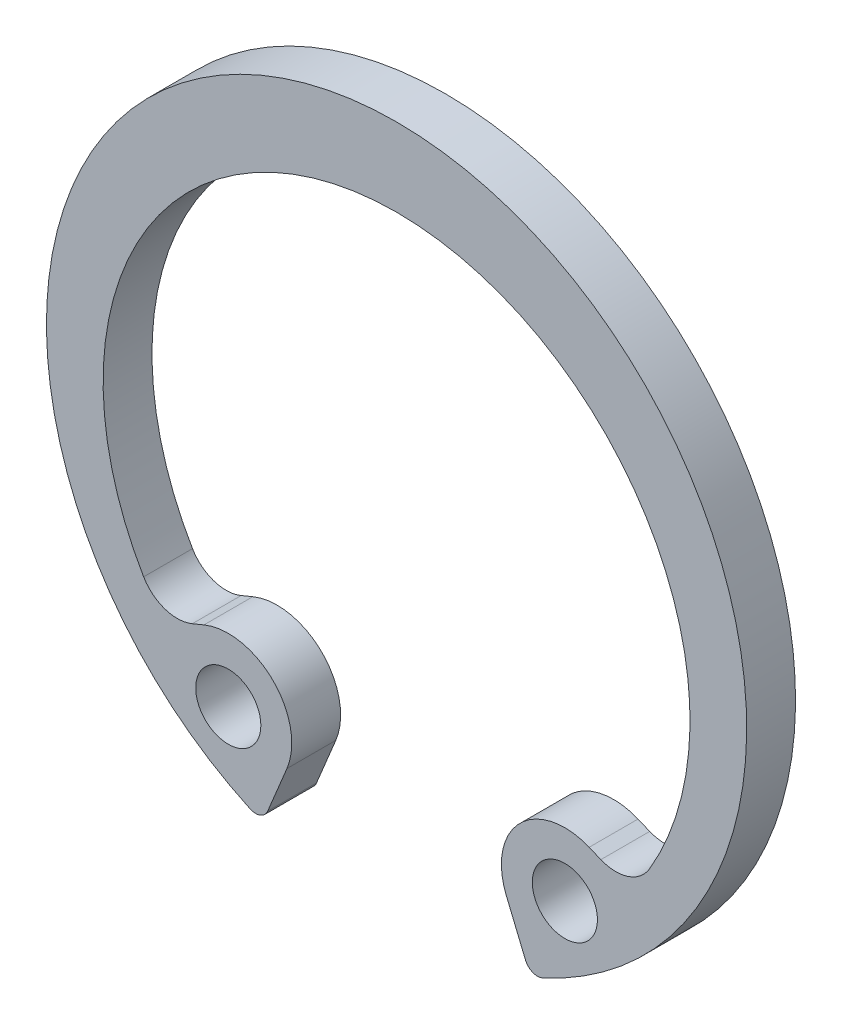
ISO-10303-21;
HEADER;
FILE_DESCRIPTION(('STEP AP214'),'2;1');
FILE_NAME('part.step','',(''),(''),'','','');
FILE_SCHEMA(('AUTOMOTIVE_DESIGN { 1 0 10303 214 1 1 1 1 }'));
ENDSEC;
DATA;
#1=APPLICATION_CONTEXT('core data for automotive mechanical design processes');
#2=APPLICATION_PROTOCOL_DEFINITION('international standard','automotive_design',2000,#1);
#3=PRODUCT_CONTEXT('',#1,'mechanical');
#4=PRODUCT('Part','Part','',(#3));
#5=PRODUCT_RELATED_PRODUCT_CATEGORY('part','',(#4));
#6=PRODUCT_DEFINITION_FORMATION('','',#4);
#7=PRODUCT_DEFINITION_CONTEXT('part definition',#1,'design');
#8=PRODUCT_DEFINITION('design','',#6,#7);
#9=PRODUCT_DEFINITION_SHAPE('','',#8);
#10=(LENGTH_UNIT() NAMED_UNIT(*) SI_UNIT(.MILLI.,.METRE.));
#11=(NAMED_UNIT(*) PLANE_ANGLE_UNIT() SI_UNIT($,.RADIAN.));
#12=(NAMED_UNIT(*) SI_UNIT($,.STERADIAN.) SOLID_ANGLE_UNIT());
#13=UNCERTAINTY_MEASURE_WITH_UNIT(LENGTH_MEASURE(1.E-05),#10,'distance_accuracy_value','');
#14=(GEOMETRIC_REPRESENTATION_CONTEXT(3) GLOBAL_UNCERTAINTY_ASSIGNED_CONTEXT((#13)) GLOBAL_UNIT_ASSIGNED_CONTEXT((#10,
#11,#12)) REPRESENTATION_CONTEXT('',''));
#15=CARTESIAN_POINT('',(0.,0.,0.));
#16=DIRECTION('',(0.,0.,1.));
#17=DIRECTION('',(1.,0.,0.));
#18=AXIS2_PLACEMENT_3D('',#15,#16,#17);
#19=CARTESIAN_POINT('',(-5.16725455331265,-7.38102840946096,1.5));
#20=DIRECTION('',(0.,0.,-1.));
#21=DIRECTION('',(-1.,0.,0.));
#22=AXIS2_PLACEMENT_3D('',#19,#20,#21);
#23=CYLINDRICAL_SURFACE('',#22,1.9493234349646);
#24=CARTESIAN_POINT('',(-5.16725455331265,-7.38102840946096,0.));
#25=DIRECTION('',(0.,0.,1.));
#26=DIRECTION('',(1.,0.,0.));
#27=AXIS2_PLACEMENT_3D('',#24,#25,#26);
#28=CIRCLE('',#27,1.9493234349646);
#29=CARTESIAN_POINT('',(-5.91322833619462,-5.58008838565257,0.));
#30=VERTEX_POINT('',#29);
#31=CARTESIAN_POINT('',(-3.36631452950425,-8.12700219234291,0.));
#32=VERTEX_POINT('',#31);
#33=EDGE_CURVE('E139',#30,#32,#28,.F.);
#34=ORIENTED_EDGE('',*,*,#33,.F.);
#35=DIRECTION('',(0.,0.,-1.));
#36=VECTOR('',#35,1.);
#37=CARTESIAN_POINT('',(-5.91322833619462,-5.58008838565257,1.5));
#38=LINE('',#37,#36);
#39=CARTESIAN_POINT('',(-5.91322833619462,-5.58008838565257,1.5));
#40=VERTEX_POINT('',#39);
#41=EDGE_CURVE('E134',#40,#30,#38,.T.);
#42=ORIENTED_EDGE('',*,*,#41,.F.);
#43=CARTESIAN_POINT('',(-5.16725455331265,-7.38102840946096,1.5));
#44=DIRECTION('',(0.,0.,1.));
#45=DIRECTION('',(1.,0.,0.));
#46=AXIS2_PLACEMENT_3D('',#43,#44,#45);
#47=CIRCLE('',#46,1.9493234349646);
#48=CARTESIAN_POINT('',(-3.36631452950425,-8.12700219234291,1.5));
#49=VERTEX_POINT('',#48);
#50=EDGE_CURVE('E137',#40,#49,#47,.F.);
#51=ORIENTED_EDGE('',*,*,#50,.T.);
#52=DIRECTION('',(0.,0.,-1.));
#53=VECTOR('',#52,1.);
#54=CARTESIAN_POINT('',(-3.36631452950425,-8.12700219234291,1.5));
#55=LINE('',#54,#53);
#56=EDGE_CURVE('E181',#49,#32,#55,.T.);
#57=ORIENTED_EDGE('',*,*,#56,.T.);
#58=EDGE_LOOP('',(#34,#42,#51,#57));
#59=FACE_BOUND('',#58,.T.);
#60=ADVANCED_FACE('F41',(#59),#23,.T.);
#61=CARTESIAN_POINT('',(1.10688692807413,-2.67226143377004,1.5));
#62=DIRECTION('',(0.382683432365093,-0.923879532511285,0.));
#63=DIRECTION('',(0.923879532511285,0.382683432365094,0.));
#64=AXIS2_PLACEMENT_3D('',#61,#62,#63);
#65=PLANE('',#64);
#66=DIRECTION('',(-0.923879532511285,-0.382683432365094,0.));
#67=VECTOR('',#66,1.);
#68=CARTESIAN_POINT('',(1.10688692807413,-2.67226143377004,0.));
#69=LINE('',#68,#67);
#70=CARTESIAN_POINT('',(-6.27228970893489,-5.7288164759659,0.));
#71=VERTEX_POINT('',#70);
#72=EDGE_CURVE('E183',#30,#71,#69,.T.);
#73=ORIENTED_EDGE('',*,*,#72,.T.);
#74=DIRECTION('',(0.,0.,1.));
#75=VECTOR('',#74,1.);
#76=CARTESIAN_POINT('',(-6.27228970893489,-5.7288164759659,1.5));
#77=LINE('',#76,#75);
#78=CARTESIAN_POINT('',(-6.27228970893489,-5.7288164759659,1.5));
#79=VERTEX_POINT('',#78);
#80=EDGE_CURVE('E150',#71,#79,#77,.T.);
#81=ORIENTED_EDGE('',*,*,#80,.T.);
#82=DIRECTION('',(-0.923879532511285,-0.382683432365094,0.));
#83=VECTOR('',#82,1.);
#84=CARTESIAN_POINT('',(1.10688692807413,-2.67226143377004,1.5));
#85=LINE('',#84,#83);
#86=EDGE_CURVE('E147',#40,#79,#85,.T.);
#87=ORIENTED_EDGE('',*,*,#86,.F.);
#88=ORIENTED_EDGE('',*,*,#41,.T.);
#89=EDGE_LOOP('',(#73,#81,#87,#88));
#90=FACE_BOUND('',#89,.T.);
#91=ADVANCED_FACE('F148',(#90),#65,.F.);
#92=CARTESIAN_POINT('',(0.,-0.660000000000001,1.5));
#93=DIRECTION('',(0.,0.,-1.));
#94=DIRECTION('',(-1.,0.,0.));
#95=AXIS2_PLACEMENT_3D('',#92,#93,#94);
#96=CYLINDRICAL_SURFACE('',#95,9.01);
#97=CARTESIAN_POINT('',(0.,-0.660000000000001,0.));
#98=DIRECTION('',(0.,0.,1.));
#99=DIRECTION('',(1.,0.,0.));
#100=AXIS2_PLACEMENT_3D('',#97,#98,#99);
#101=CIRCLE('',#100,9.01);
#102=CARTESIAN_POINT('',(-7.76580071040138,-5.22863648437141,0.));
#103=VERTEX_POINT('',#102);
#104=CARTESIAN_POINT('',(7.76580071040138,-5.22863648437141,0.));
#105=VERTEX_POINT('',#104);
#106=EDGE_CURVE('E185',#103,#105,#101,.F.);
#107=ORIENTED_EDGE('',*,*,#106,.T.);
#108=DIRECTION('',(0.,0.,-1.));
#109=VECTOR('',#108,1.);
#110=CARTESIAN_POINT('',(7.76580071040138,-5.22863648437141,1.5));
#111=LINE('',#110,#109);
#112=CARTESIAN_POINT('',(7.76580071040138,-5.22863648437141,1.5));
#113=VERTEX_POINT('',#112);
#114=EDGE_CURVE('E213',#105,#113,#111,.F.);
#115=ORIENTED_EDGE('',*,*,#114,.T.);
#116=CARTESIAN_POINT('',(0.,-0.660000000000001,1.5));
#117=DIRECTION('',(0.,0.,1.));
#118=DIRECTION('',(1.,0.,0.));
#119=AXIS2_PLACEMENT_3D('',#116,#117,#118);
#120=CIRCLE('',#119,9.01);
#121=CARTESIAN_POINT('',(-7.76580071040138,-5.22863648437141,1.5));
#122=VERTEX_POINT('',#121);
#123=EDGE_CURVE('E152',#122,#113,#120,.F.);
#124=ORIENTED_EDGE('',*,*,#123,.F.);
#125=DIRECTION('',(0.,0.,-1.));
#126=VECTOR('',#125,1.);
#127=CARTESIAN_POINT('',(-7.76580071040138,-5.22863648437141,1.5));
#128=LINE('',#127,#126);
#129=EDGE_CURVE('E210',#122,#103,#128,.T.);
#130=ORIENTED_EDGE('',*,*,#129,.T.);
#131=EDGE_LOOP('',(#107,#115,#124,#130));
#132=FACE_BOUND('',#131,.T.);
#133=ADVANCED_FACE('F264',(#132),#96,.F.);
#134=CARTESIAN_POINT('',(-1.10688692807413,-2.67226143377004,1.5));
#135=DIRECTION('',(0.382683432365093,0.923879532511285,0.));
#136=DIRECTION('',(-0.923879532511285,0.382683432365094,0.));
#137=AXIS2_PLACEMENT_3D('',#134,#135,#136);
#138=PLANE('',#137);
#139=DIRECTION('',(0.923879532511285,-0.382683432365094,0.));
#140=VECTOR('',#139,1.);
#141=CARTESIAN_POINT('',(-1.10688692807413,-2.67226143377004,1.5));
#142=LINE('',#141,#140);
#143=CARTESIAN_POINT('',(5.91322833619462,-5.58008838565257,1.5));
#144=VERTEX_POINT('',#143);
#145=CARTESIAN_POINT('',(6.27228970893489,-5.7288164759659,1.5));
#146=VERTEX_POINT('',#145);
#147=EDGE_CURVE('E165',#144,#146,#142,.T.);
#148=ORIENTED_EDGE('',*,*,#147,.T.);
#149=DIRECTION('',(0.,0.,-1.));
#150=VECTOR('',#149,1.);
#151=CARTESIAN_POINT('',(6.27228970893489,-5.72881647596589,1.5));
#152=LINE('',#151,#150);
#153=CARTESIAN_POINT('',(6.27228970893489,-5.7288164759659,0.));
#154=VERTEX_POINT('',#153);
#155=EDGE_CURVE('E143',#146,#154,#152,.T.);
#156=ORIENTED_EDGE('',*,*,#155,.T.);
#157=DIRECTION('',(0.923879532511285,-0.382683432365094,0.));
#158=VECTOR('',#157,1.);
#159=CARTESIAN_POINT('',(-1.10688692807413,-2.67226143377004,0.));
#160=LINE('',#159,#158);
#161=CARTESIAN_POINT('',(5.91322833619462,-5.58008838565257,0.));
#162=VERTEX_POINT('',#161);
#163=EDGE_CURVE('E188',#162,#154,#160,.T.);
#164=ORIENTED_EDGE('',*,*,#163,.F.);
#165=DIRECTION('',(0.,0.,-1.));
#166=VECTOR('',#165,1.);
#167=CARTESIAN_POINT('',(5.91322833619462,-5.58008838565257,1.5));
#168=LINE('',#167,#166);
#169=EDGE_CURVE('E144',#144,#162,#168,.T.);
#170=ORIENTED_EDGE('',*,*,#169,.F.);
#171=EDGE_LOOP('',(#148,#156,#164,#170));
#172=FACE_BOUND('',#171,.T.);
#173=ADVANCED_FACE('F256',(#172),#138,.T.);
#174=CARTESIAN_POINT('',(5.16725455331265,-7.38102840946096,1.5));
#175=DIRECTION('',(0.,0.,-1.));
#176=DIRECTION('',(-1.,0.,0.));
#177=AXIS2_PLACEMENT_3D('',#174,#175,#176);
#178=CYLINDRICAL_SURFACE('',#177,1.9493234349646);
#179=CARTESIAN_POINT('',(5.16725455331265,-7.38102840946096,0.));
#180=DIRECTION('',(0.,0.,1.));
#181=DIRECTION('',(1.,0.,0.));
#182=AXIS2_PLACEMENT_3D('',#179,#180,#181);
#183=CIRCLE('',#182,1.9493234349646);
#184=CARTESIAN_POINT('',(3.36631452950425,-8.12700219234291,0.));
#185=VERTEX_POINT('',#184);
#186=EDGE_CURVE('E191',#162,#185,#183,.T.);
#187=ORIENTED_EDGE('',*,*,#186,.T.);
#188=DIRECTION('',(0.,0.,-1.));
#189=VECTOR('',#188,1.);
#190=CARTESIAN_POINT('',(3.36631452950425,-8.12700219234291,1.5));
#191=LINE('',#190,#189);
#192=CARTESIAN_POINT('',(3.36631452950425,-8.12700219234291,1.5));
#193=VERTEX_POINT('',#192);
#194=EDGE_CURVE('E204',#193,#185,#191,.T.);
#195=ORIENTED_EDGE('',*,*,#194,.F.);
#196=CARTESIAN_POINT('',(5.16725455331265,-7.38102840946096,1.5));
#197=DIRECTION('',(0.,0.,1.));
#198=DIRECTION('',(1.,0.,0.));
#199=AXIS2_PLACEMENT_3D('',#196,#197,#198);
#200=CIRCLE('',#199,1.9493234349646);
#201=EDGE_CURVE('E168',#144,#193,#200,.T.);
#202=ORIENTED_EDGE('',*,*,#201,.F.);
#203=ORIENTED_EDGE('',*,*,#169,.T.);
#204=EDGE_LOOP('',(#187,#195,#202,#203));
#205=FACE_BOUND('',#204,.T.);
#206=ADVANCED_FACE('F252',(#205),#178,.T.);
#207=CARTESIAN_POINT('',(0.,0.,1.5));
#208=DIRECTION('',(0.923879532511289,0.382683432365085,0.));
#209=DIRECTION('',(-0.382683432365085,0.923879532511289,0.));
#210=AXIS2_PLACEMENT_3D('',#207,#208,#209);
#211=PLANE('',#210);
#212=DIRECTION('',(0.382683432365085,-0.923879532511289,0.));
#213=VECTOR('',#212,1.);
#214=CARTESIAN_POINT('',(0.,0.,0.));
#215=LINE('',#214,#213);
#216=CARTESIAN_POINT('',(3.95781448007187,-9.55500939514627,0.));
#217=VERTEX_POINT('',#216);
#218=EDGE_CURVE('E193',#185,#217,#215,.T.);
#219=ORIENTED_EDGE('',*,*,#218,.T.);
#220=DIRECTION('',(0.,0.,-1.));
#221=VECTOR('',#220,1.);
#222=CARTESIAN_POINT('',(3.95781448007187,-9.55500939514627,1.5));
#223=LINE('',#222,#221);
#224=CARTESIAN_POINT('',(3.95781448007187,-9.55500939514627,1.5));
#225=VERTEX_POINT('',#224);
#226=EDGE_CURVE('E64',#217,#225,#223,.F.);
#227=ORIENTED_EDGE('',*,*,#226,.T.);
#228=DIRECTION('',(0.382683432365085,-0.923879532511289,0.));
#229=VECTOR('',#228,1.);
#230=CARTESIAN_POINT('',(0.,0.,1.5));
#231=LINE('',#230,#229);
#232=EDGE_CURVE('E170',#193,#225,#231,.T.);
#233=ORIENTED_EDGE('',*,*,#232,.F.);
#234=ORIENTED_EDGE('',*,*,#194,.T.);
#235=EDGE_LOOP('',(#219,#227,#233,#234));
#236=FACE_BOUND('',#235,.T.);
#237=ADVANCED_FACE('F248',(#236),#211,.F.);
#238=CARTESIAN_POINT('',(0.,0.,1.5));
#239=DIRECTION('',(0.,0.,-1.));
#240=DIRECTION('',(-1.,0.,0.));
#241=AXIS2_PLACEMENT_3D('',#238,#239,#240);
#242=CYLINDRICAL_SURFACE('',#241,10.75);
#243=CARTESIAN_POINT('',(0.,0.,1.5));
#244=DIRECTION('',(0.,0.,1.));
#245=DIRECTION('',(1.,0.,0.));
#246=AXIS2_PLACEMENT_3D('',#243,#244,#245);
#247=CIRCLE('',#246,10.75);
#248=CARTESIAN_POINT('',(4.49460750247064,-9.76529586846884,1.5));
#249=VERTEX_POINT('',#248);
#250=CARTESIAN_POINT('',(-4.49460750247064,-9.76529586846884,1.5));
#251=VERTEX_POINT('',#250);
#252=EDGE_CURVE('E172',#249,#251,#247,.T.);
#253=ORIENTED_EDGE('',*,*,#252,.F.);
#254=DIRECTION('',(0.,0.,-1.));
#255=VECTOR('',#254,1.);
#256=CARTESIAN_POINT('',(4.49460750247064,-9.76529586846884,1.5));
#257=LINE('',#256,#255);
#258=CARTESIAN_POINT('',(4.49460750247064,-9.76529586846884,0.));
#259=VERTEX_POINT('',#258);
#260=EDGE_CURVE('E226',#249,#259,#257,.T.);
#261=ORIENTED_EDGE('',*,*,#260,.T.);
#262=CARTESIAN_POINT('',(0.,0.,0.));
#263=DIRECTION('',(0.,0.,1.));
#264=DIRECTION('',(1.,0.,0.));
#265=AXIS2_PLACEMENT_3D('',#262,#263,#264);
#266=CIRCLE('',#265,10.75);
#267=CARTESIAN_POINT('',(-4.49460750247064,-9.76529586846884,0.));
#268=VERTEX_POINT('',#267);
#269=EDGE_CURVE('E195',#259,#268,#266,.T.);
#270=ORIENTED_EDGE('',*,*,#269,.T.);
#271=DIRECTION('',(0.,0.,-1.));
#272=VECTOR('',#271,1.);
#273=CARTESIAN_POINT('',(-4.49460750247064,-9.76529586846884,1.5));
#274=LINE('',#273,#272);
#275=EDGE_CURVE('E224',#268,#251,#274,.F.);
#276=ORIENTED_EDGE('',*,*,#275,.T.);
#277=EDGE_LOOP('',(#253,#261,#270,#276));
#278=FACE_BOUND('',#277,.T.);
#279=ADVANCED_FACE('F239',(#278),#242,.T.);
#280=CARTESIAN_POINT('',(5.16725455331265,-7.38102840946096,1.5));
#281=DIRECTION('',(0.,0.,-1.));
#282=DIRECTION('',(-1.,0.,0.));
#283=AXIS2_PLACEMENT_3D('',#280,#281,#282);
#284=CYLINDRICAL_SURFACE('',#283,1.);
#285=CARTESIAN_POINT('',(5.16725455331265,-7.38102840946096,1.5));
#286=DIRECTION('',(0.,0.,1.));
#287=DIRECTION('',(1.,0.,0.));
#288=AXIS2_PLACEMENT_3D('',#285,#286,#287);
#289=CIRCLE('',#288,1.);
#290=CARTESIAN_POINT('',(6.16725455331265,-7.38102840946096,1.5));
#291=VERTEX_POINT('',#290);
#292=EDGE_CURVE('E175',#291,#291,#289,.T.);
#293=ORIENTED_EDGE('',*,*,#292,.T.);
#294=EDGE_LOOP('',(#293));
#295=FACE_BOUND('',#294,.T.);
#296=CARTESIAN_POINT('',(5.16725455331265,-7.38102840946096,0.));
#297=DIRECTION('',(0.,0.,1.));
#298=DIRECTION('',(1.,0.,0.));
#299=AXIS2_PLACEMENT_3D('',#296,#297,#298);
#300=CIRCLE('',#299,1.);
#301=CARTESIAN_POINT('',(6.16725455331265,-7.38102840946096,0.));
#302=VERTEX_POINT('',#301);
#303=EDGE_CURVE('E160',#302,#302,#300,.T.);
#304=ORIENTED_EDGE('',*,*,#303,.F.);
#305=EDGE_LOOP('',(#304));
#306=FACE_BOUND('',#305,.T.);
#307=ADVANCED_FACE('F311',(#295,#306),#284,.F.);
#308=CARTESIAN_POINT('',(0.,0.,1.5));
#309=DIRECTION('',(0.923879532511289,-0.382683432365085,0.));
#310=DIRECTION('',(0.382683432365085,0.923879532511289,0.));
#311=AXIS2_PLACEMENT_3D('',#308,#309,#310);
#312=PLANE('',#311);
#313=DIRECTION('',(-0.382683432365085,-0.923879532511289,0.));
#314=VECTOR('',#313,1.);
#315=CARTESIAN_POINT('',(0.,0.,1.5));
#316=LINE('',#315,#314);
#317=CARTESIAN_POINT('',(-3.95781448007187,-9.55500939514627,1.5));
#318=VERTEX_POINT('',#317);
#319=EDGE_CURVE('E156',#49,#318,#316,.T.);
#320=ORIENTED_EDGE('',*,*,#319,.T.);
#321=DIRECTION('',(0.,0.,1.));
#322=VECTOR('',#321,1.);
#323=CARTESIAN_POINT('',(-3.95781448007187,-9.55500939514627,0.));
#324=LINE('',#323,#322);
#325=CARTESIAN_POINT('',(-3.95781448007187,-9.55500939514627,0.));
#326=VERTEX_POINT('',#325);
#327=EDGE_CURVE('E11',#318,#326,#324,.F.);
#328=ORIENTED_EDGE('',*,*,#327,.T.);
#329=DIRECTION('',(-0.382683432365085,-0.923879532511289,0.));
#330=VECTOR('',#329,1.);
#331=CARTESIAN_POINT('',(0.,0.,0.));
#332=LINE('',#331,#330);
#333=EDGE_CURVE('E198',#32,#326,#332,.T.);
#334=ORIENTED_EDGE('',*,*,#333,.F.);
#335=ORIENTED_EDGE('',*,*,#56,.F.);
#336=EDGE_LOOP('',(#320,#328,#334,#335));
#337=FACE_BOUND('',#336,.T.);
#338=ADVANCED_FACE('F271',(#337),#312,.T.);
#339=CARTESIAN_POINT('',(-5.16725455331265,-7.38102840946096,1.5));
#340=DIRECTION('',(0.,0.,-1.));
#341=DIRECTION('',(-1.,0.,0.));
#342=AXIS2_PLACEMENT_3D('',#339,#340,#341);
#343=CYLINDRICAL_SURFACE('',#342,1.);
#344=CARTESIAN_POINT('',(-5.16725455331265,-7.38102840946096,1.5));
#345=DIRECTION('',(0.,0.,1.));
#346=DIRECTION('',(1.,0.,0.));
#347=AXIS2_PLACEMENT_3D('',#344,#345,#346);
#348=CIRCLE('',#347,1.);
#349=CARTESIAN_POINT('',(-4.16725455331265,-7.38102840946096,1.5));
#350=VERTEX_POINT('',#349);
#351=EDGE_CURVE('E178',#350,#350,#348,.F.);
#352=ORIENTED_EDGE('',*,*,#351,.F.);
#353=EDGE_LOOP('',(#352));
#354=FACE_BOUND('',#353,.T.);
#355=CARTESIAN_POINT('',(-5.16725455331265,-7.38102840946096,0.));
#356=DIRECTION('',(0.,0.,1.));
#357=DIRECTION('',(1.,0.,0.));
#358=AXIS2_PLACEMENT_3D('',#355,#356,#357);
#359=CIRCLE('',#358,1.);
#360=CARTESIAN_POINT('',(-4.16725455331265,-7.38102840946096,0.));
#361=VERTEX_POINT('',#360);
#362=EDGE_CURVE('E157',#361,#361,#359,.F.);
#363=ORIENTED_EDGE('',*,*,#362,.T.);
#364=EDGE_LOOP('',(#363));
#365=FACE_BOUND('',#364,.T.);
#366=ADVANCED_FACE('F320',(#354,#365),#343,.F.);
#367=CARTESIAN_POINT('',(0.,0.,1.5));
#368=DIRECTION('',(0.,0.,1.));
#369=DIRECTION('',(1.,0.,0.));
#370=AXIS2_PLACEMENT_3D('',#367,#368,#369);
#371=PLANE('',#370);
#372=ORIENTED_EDGE('',*,*,#232,.T.);
#373=CARTESIAN_POINT('',(4.32736629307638,-9.40193602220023,1.5));
#374=DIRECTION('',(0.,0.,1.));
#375=DIRECTION('',(1.,0.,0.));
#376=AXIS2_PLACEMENT_3D('',#373,#374,#375);
#377=CIRCLE('',#376,0.4);
#378=EDGE_CURVE('E49',#225,#249,#377,.T.);
#379=ORIENTED_EDGE('',*,*,#378,.T.);
#380=ORIENTED_EDGE('',*,*,#252,.T.);
#381=CARTESIAN_POINT('',(-4.32736629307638,-9.40193602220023,1.5));
#382=DIRECTION('',(0.,0.,1.));
#383=DIRECTION('',(1.,0.,0.));
#384=AXIS2_PLACEMENT_3D('',#381,#382,#383);
#385=CIRCLE('',#384,0.4);
#386=EDGE_CURVE('E56',#251,#318,#385,.T.);
#387=ORIENTED_EDGE('',*,*,#386,.T.);
#388=ORIENTED_EDGE('',*,*,#319,.F.);
#389=ORIENTED_EDGE('',*,*,#50,.F.);
#390=ORIENTED_EDGE('',*,*,#86,.T.);
#391=CARTESIAN_POINT('',(-6.731509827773,-4.62016103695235,1.5));
#392=DIRECTION('',(0.,0.,1.));
#393=DIRECTION('',(1.,0.,0.));
#394=AXIS2_PLACEMENT_3D('',#391,#392,#393);
#395=CIRCLE('',#394,1.2);
#396=EDGE_CURVE('E222',#79,#122,#395,.F.);
#397=ORIENTED_EDGE('',*,*,#396,.T.);
#398=ORIENTED_EDGE('',*,*,#123,.T.);
#399=CARTESIAN_POINT('',(6.731509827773,-4.62016103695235,1.5));
#400=DIRECTION('',(0.,0.,1.));
#401=DIRECTION('',(1.,0.,0.));
#402=AXIS2_PLACEMENT_3D('',#399,#400,#401);
#403=CIRCLE('',#402,1.2);
#404=EDGE_CURVE('E218',#113,#146,#403,.F.);
#405=ORIENTED_EDGE('',*,*,#404,.T.);
#406=ORIENTED_EDGE('',*,*,#147,.F.);
#407=ORIENTED_EDGE('',*,*,#201,.T.);
#408=EDGE_LOOP('',(#372,#379,#380,#387,#388,#389,#390,#397,#398,#405,#406,#407));
#409=FACE_BOUND('',#408,.T.);
#410=ORIENTED_EDGE('',*,*,#292,.F.);
#411=EDGE_LOOP('',(#410));
#412=FACE_BOUND('',#411,.T.);
#413=ORIENTED_EDGE('',*,*,#351,.T.);
#414=EDGE_LOOP('',(#413));
#415=FACE_BOUND('',#414,.T.);
#416=ADVANCED_FACE('F154',(#409,#412,#415),#371,.T.);
#417=CARTESIAN_POINT('',(0.,0.,0.));
#418=DIRECTION('',(0.,0.,1.));
#419=DIRECTION('',(1.,0.,0.));
#420=AXIS2_PLACEMENT_3D('',#417,#418,#419);
#421=PLANE('',#420);
#422=ORIENTED_EDGE('',*,*,#269,.F.);
#423=CARTESIAN_POINT('',(4.32736629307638,-9.40193602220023,0.));
#424=DIRECTION('',(0.,0.,1.));
#425=DIRECTION('',(1.,0.,0.));
#426=AXIS2_PLACEMENT_3D('',#423,#424,#425);
#427=CIRCLE('',#426,0.4);
#428=EDGE_CURVE('E231',#259,#217,#427,.F.);
#429=ORIENTED_EDGE('',*,*,#428,.T.);
#430=ORIENTED_EDGE('',*,*,#218,.F.);
#431=ORIENTED_EDGE('',*,*,#186,.F.);
#432=ORIENTED_EDGE('',*,*,#163,.T.);
#433=CARTESIAN_POINT('',(6.731509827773,-4.62016103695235,0.));
#434=DIRECTION('',(0.,0.,1.));
#435=DIRECTION('',(1.,0.,0.));
#436=AXIS2_PLACEMENT_3D('',#433,#434,#435);
#437=CIRCLE('',#436,1.2);
#438=EDGE_CURVE('E216',#154,#105,#437,.T.);
#439=ORIENTED_EDGE('',*,*,#438,.T.);
#440=ORIENTED_EDGE('',*,*,#106,.F.);
#441=CARTESIAN_POINT('',(-6.731509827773,-4.62016103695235,0.));
#442=DIRECTION('',(0.,0.,1.));
#443=DIRECTION('',(1.,0.,0.));
#444=AXIS2_PLACEMENT_3D('',#441,#442,#443);
#445=CIRCLE('',#444,1.2);
#446=EDGE_CURVE('E220',#103,#71,#445,.T.);
#447=ORIENTED_EDGE('',*,*,#446,.T.);
#448=ORIENTED_EDGE('',*,*,#72,.F.);
#449=ORIENTED_EDGE('',*,*,#33,.T.);
#450=ORIENTED_EDGE('',*,*,#333,.T.);
#451=CARTESIAN_POINT('',(-4.32736629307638,-9.40193602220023,0.));
#452=DIRECTION('',(0.,0.,1.));
#453=DIRECTION('',(1.,0.,0.));
#454=AXIS2_PLACEMENT_3D('',#451,#452,#453);
#455=CIRCLE('',#454,0.4);
#456=EDGE_CURVE('E229',#326,#268,#455,.F.);
#457=ORIENTED_EDGE('',*,*,#456,.T.);
#458=EDGE_LOOP('',(#422,#429,#430,#431,#432,#439,#440,#447,#448,#449,#450,#457));
#459=FACE_BOUND('',#458,.T.);
#460=ORIENTED_EDGE('',*,*,#303,.T.);
#461=EDGE_LOOP('',(#460));
#462=FACE_BOUND('',#461,.T.);
#463=ORIENTED_EDGE('',*,*,#362,.F.);
#464=EDGE_LOOP('',(#463));
#465=FACE_BOUND('',#464,.T.);
#466=ADVANCED_FACE('F245',(#459,#462,#465),#421,.F.);
#467=CARTESIAN_POINT('',(6.731509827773,-4.62016103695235,1.5));
#468=DIRECTION('',(0.,0.,-1.));
#469=DIRECTION('',(-1.,0.,0.));
#470=AXIS2_PLACEMENT_3D('',#467,#468,#469);
#471=CYLINDRICAL_SURFACE('',#470,1.2);
#472=ORIENTED_EDGE('',*,*,#404,.F.);
#473=ORIENTED_EDGE('',*,*,#114,.F.);
#474=ORIENTED_EDGE('',*,*,#438,.F.);
#475=ORIENTED_EDGE('',*,*,#155,.F.);
#476=EDGE_LOOP('',(#472,#473,#474,#475));
#477=FACE_BOUND('',#476,.T.);
#478=ADVANCED_FACE('F260',(#477),#471,.F.);
#479=CARTESIAN_POINT('',(-6.731509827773,-4.62016103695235,1.5));
#480=DIRECTION('',(0.,0.,-1.));
#481=DIRECTION('',(-1.,0.,0.));
#482=AXIS2_PLACEMENT_3D('',#479,#480,#481);
#483=CYLINDRICAL_SURFACE('',#482,1.2);
#484=ORIENTED_EDGE('',*,*,#396,.F.);
#485=ORIENTED_EDGE('',*,*,#80,.F.);
#486=ORIENTED_EDGE('',*,*,#446,.F.);
#487=ORIENTED_EDGE('',*,*,#129,.F.);
#488=EDGE_LOOP('',(#484,#485,#486,#487));
#489=FACE_BOUND('',#488,.T.);
#490=ADVANCED_FACE('F268',(#489),#483,.F.);
#491=CARTESIAN_POINT('',(4.32736629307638,-9.40193602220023,1.5));
#492=DIRECTION('',(0.,0.,-1.));
#493=DIRECTION('',(-1.,0.,0.));
#494=AXIS2_PLACEMENT_3D('',#491,#492,#493);
#495=CYLINDRICAL_SURFACE('',#494,0.4);
#496=ORIENTED_EDGE('',*,*,#378,.F.);
#497=ORIENTED_EDGE('',*,*,#226,.F.);
#498=ORIENTED_EDGE('',*,*,#428,.F.);
#499=ORIENTED_EDGE('',*,*,#260,.F.);
#500=EDGE_LOOP('',(#496,#497,#498,#499));
#501=FACE_BOUND('',#500,.T.);
#502=ADVANCED_FACE('F242',(#501),#495,.T.);
#503=CARTESIAN_POINT('',(-4.32736629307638,-9.40193602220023,1.5));
#504=DIRECTION('',(0.,0.,-1.));
#505=DIRECTION('',(-1.,0.,0.));
#506=AXIS2_PLACEMENT_3D('',#503,#504,#505);
#507=CYLINDRICAL_SURFACE('',#506,0.4);
#508=ORIENTED_EDGE('',*,*,#386,.F.);
#509=ORIENTED_EDGE('',*,*,#275,.F.);
#510=ORIENTED_EDGE('',*,*,#456,.F.);
#511=ORIENTED_EDGE('',*,*,#327,.F.);
#512=EDGE_LOOP('',(#508,#509,#510,#511));
#513=FACE_BOUND('',#512,.T.);
#514=ADVANCED_FACE('F43',(#513),#507,.T.);
#515=CLOSED_SHELL('',(#60,#91,#133,#173,#206,#237,#279,#307,#338,#366,#416,#466,#478,#490,#502,#514));
#516=MANIFOLD_SOLID_BREP('B2',#515);
#517=ADVANCED_BREP_SHAPE_REPRESENTATION('',(#18,#516),#14);
#518=SHAPE_DEFINITION_REPRESENTATION(#9,#517);
ENDSEC;
END-ISO-10303-21;
